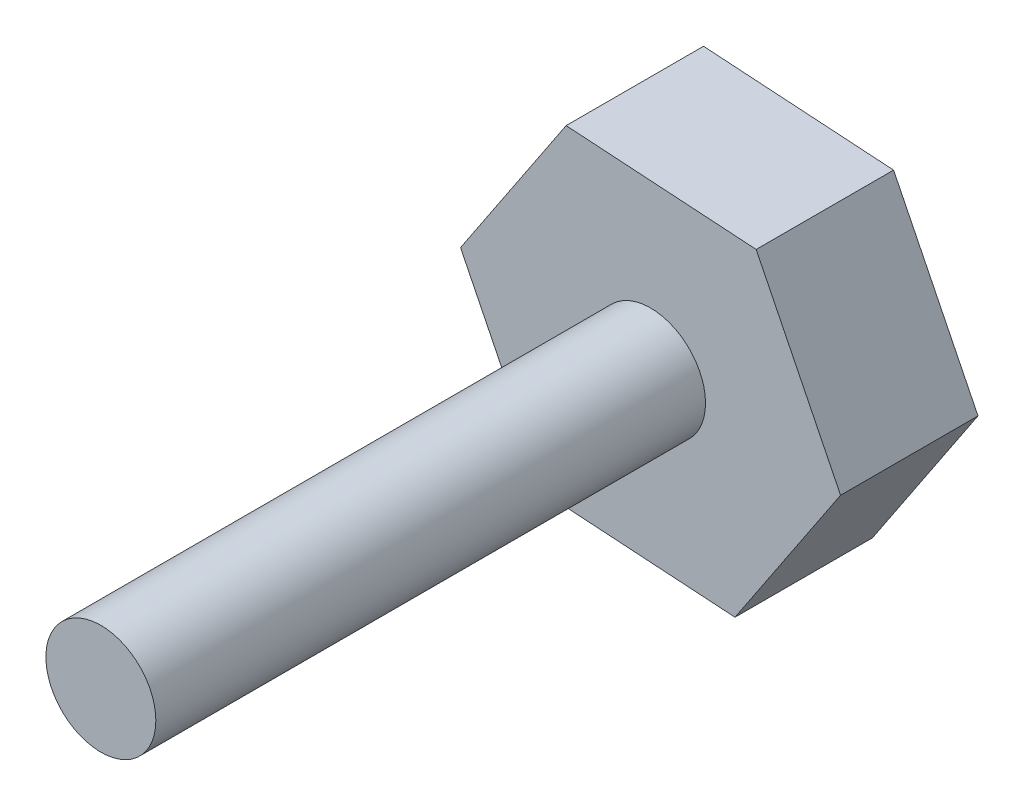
ISO-10303-21;
HEADER;
FILE_DESCRIPTION(('STEP AP214'),'2;1');
FILE_NAME('part.step','',(''),(''),'','','');
FILE_SCHEMA(('AUTOMOTIVE_DESIGN { 1 0 10303 214 1 1 1 1 }'));
ENDSEC;
DATA;
#1=APPLICATION_CONTEXT('core data for automotive mechanical design processes');
#2=APPLICATION_PROTOCOL_DEFINITION('international standard','automotive_design',2000,#1);
#3=PRODUCT_CONTEXT('',#1,'mechanical');
#4=PRODUCT('Part','Part','',(#3));
#5=PRODUCT_RELATED_PRODUCT_CATEGORY('part','',(#4));
#6=PRODUCT_DEFINITION_FORMATION('','',#4);
#7=PRODUCT_DEFINITION_CONTEXT('part definition',#1,'design');
#8=PRODUCT_DEFINITION('design','',#6,#7);
#9=PRODUCT_DEFINITION_SHAPE('','',#8);
#10=(LENGTH_UNIT() NAMED_UNIT(*) SI_UNIT(.MILLI.,.METRE.));
#11=(NAMED_UNIT(*) PLANE_ANGLE_UNIT() SI_UNIT($,.RADIAN.));
#12=(NAMED_UNIT(*) SI_UNIT($,.STERADIAN.) SOLID_ANGLE_UNIT());
#13=UNCERTAINTY_MEASURE_WITH_UNIT(LENGTH_MEASURE(1.E-05),#10,'distance_accuracy_value','');
#14=(GEOMETRIC_REPRESENTATION_CONTEXT(3) GLOBAL_UNCERTAINTY_ASSIGNED_CONTEXT((#13)) GLOBAL_UNIT_ASSIGNED_CONTEXT((#10,
#11,#12)) REPRESENTATION_CONTEXT('',''));
#15=CARTESIAN_POINT('',(0.,0.,0.));
#16=DIRECTION('',(0.,0.,1.));
#17=DIRECTION('',(1.,0.,0.));
#18=AXIS2_PLACEMENT_3D('',#15,#16,#17);
#19=CARTESIAN_POINT('',(0.,0.,6.35));
#20=DIRECTION('',(0.,0.,1.));
#21=DIRECTION('',(1.,0.,0.));
#22=AXIS2_PLACEMENT_3D('',#19,#20,#21);
#23=PLANE('',#22);
#24=DIRECTION('',(0.997935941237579,-0.0642172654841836,0.));
#25=VECTOR('',#24,1.);
#26=CARTESIAN_POINT('',(-4.87966397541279,-7.32175385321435,6.35));
#27=LINE('',#26,#25);
#28=CARTESIAN_POINT('',(-4.87966397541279,-7.32175385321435,6.35));
#29=VERTEX_POINT('',#28);
#30=CARTESIAN_POINT('',(3.90099284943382,-7.88678989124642,6.35));
#31=VERTEX_POINT('',#30);
#32=EDGE_CURVE('E129',#29,#31,#27,.T.);
#33=ORIENTED_EDGE('',*,*,#32,.T.);
#34=DIRECTION('',(0.554581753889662,0.832129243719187,0.));
#35=VECTOR('',#34,1.);
#36=CARTESIAN_POINT('',(3.90099284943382,-7.88678989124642,6.35));
#37=LINE('',#36,#35);
#38=CARTESIAN_POINT('',(8.78065682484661,-0.565036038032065,6.35));
#39=VERTEX_POINT('',#38);
#40=EDGE_CURVE('E87',#31,#39,#37,.T.);
#41=ORIENTED_EDGE('',*,*,#40,.T.);
#42=DIRECTION('',(-0.443354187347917,0.89634650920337,0.));
#43=VECTOR('',#42,1.);
#44=CARTESIAN_POINT('',(8.78065682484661,-0.565036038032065,6.35));
#45=LINE('',#44,#43);
#46=CARTESIAN_POINT('',(4.87966397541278,7.32175385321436,6.35));
#47=VERTEX_POINT('',#46);
#48=EDGE_CURVE('E100',#39,#47,#45,.T.);
#49=ORIENTED_EDGE('',*,*,#48,.T.);
#50=DIRECTION('',(-0.99793594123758,0.0642172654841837,0.));
#51=VECTOR('',#50,1.);
#52=CARTESIAN_POINT('',(4.87966397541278,7.32175385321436,6.35));
#53=LINE('',#52,#51);
#54=CARTESIAN_POINT('',(-3.90099284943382,7.88678989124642,6.35));
#55=VERTEX_POINT('',#54);
#56=EDGE_CURVE('E94',#47,#55,#53,.T.);
#57=ORIENTED_EDGE('',*,*,#56,.T.);
#58=DIRECTION('',(-0.554581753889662,-0.832129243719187,0.));
#59=VECTOR('',#58,1.);
#60=CARTESIAN_POINT('',(-3.90099284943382,7.88678989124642,6.35));
#61=LINE('',#60,#59);
#62=CARTESIAN_POINT('',(-8.78065682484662,0.565036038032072,6.35));
#63=VERTEX_POINT('',#62);
#64=EDGE_CURVE('E98',#55,#63,#61,.T.);
#65=ORIENTED_EDGE('',*,*,#64,.T.);
#66=DIRECTION('',(0.443354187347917,-0.896346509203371,0.));
#67=VECTOR('',#66,1.);
#68=CARTESIAN_POINT('',(-8.78065682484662,0.565036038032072,6.35));
#69=LINE('',#68,#67);
#70=EDGE_CURVE('E50',#63,#29,#69,.T.);
#71=ORIENTED_EDGE('',*,*,#70,.T.);
#72=EDGE_LOOP('',(#33,#41,#49,#57,#65,#71));
#73=FACE_BOUND('',#72,.T.);
#74=CARTESIAN_POINT('',(0.,0.,6.35));
#75=DIRECTION('',(0.,0.,1.));
#76=DIRECTION('',(1.,0.,0.));
#77=AXIS2_PLACEMENT_3D('',#74,#75,#76);
#78=CIRCLE('',#77,2.54);
#79=CARTESIAN_POINT('',(2.54,0.,6.35));
#80=VERTEX_POINT('',#79);
#81=EDGE_CURVE('E169',#80,#80,#78,.T.);
#82=ORIENTED_EDGE('',*,*,#81,.F.);
#83=EDGE_LOOP('',(#82));
#84=FACE_BOUND('',#83,.T.);
#85=ADVANCED_FACE('F33',(#73,#84),#23,.T.);
#86=CARTESIAN_POINT('',(-4.87966397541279,-7.32175385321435,6.35));
#87=DIRECTION('',(0.0642172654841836,0.997935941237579,0.));
#88=DIRECTION('',(-0.99793594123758,0.0642172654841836,0.));
#89=AXIS2_PLACEMENT_3D('',#86,#87,#88);
#90=PLANE('',#89);
#91=DIRECTION('',(0.997935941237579,-0.0642172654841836,0.));
#92=VECTOR('',#91,1.);
#93=CARTESIAN_POINT('',(-4.87966397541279,-7.32175385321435,0.));
#94=LINE('',#93,#92);
#95=CARTESIAN_POINT('',(-4.87966397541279,-7.32175385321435,0.));
#96=VERTEX_POINT('',#95);
#97=CARTESIAN_POINT('',(3.90099284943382,-7.88678989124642,0.));
#98=VERTEX_POINT('',#97);
#99=EDGE_CURVE('E118',#96,#98,#94,.T.);
#100=ORIENTED_EDGE('',*,*,#99,.T.);
#101=DIRECTION('',(0.,0.,-1.));
#102=VECTOR('',#101,1.);
#103=CARTESIAN_POINT('',(3.90099284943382,-7.88678989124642,6.35));
#104=LINE('',#103,#102);
#105=EDGE_CURVE('E11',#31,#98,#104,.T.);
#106=ORIENTED_EDGE('',*,*,#105,.F.);
#107=ORIENTED_EDGE('',*,*,#32,.F.);
#108=DIRECTION('',(0.,0.,-1.));
#109=VECTOR('',#108,1.);
#110=CARTESIAN_POINT('',(-4.87966397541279,-7.32175385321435,6.35));
#111=LINE('',#110,#109);
#112=EDGE_CURVE('E114',#29,#96,#111,.T.);
#113=ORIENTED_EDGE('',*,*,#112,.T.);
#114=EDGE_LOOP('',(#100,#106,#107,#113));
#115=FACE_BOUND('',#114,.T.);
#116=ADVANCED_FACE('F35',(#115),#90,.F.);
#117=CARTESIAN_POINT('',(3.90099284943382,-7.88678989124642,6.35));
#118=DIRECTION('',(-0.832129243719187,0.554581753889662,0.));
#119=DIRECTION('',(-0.554581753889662,-0.832129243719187,0.));
#120=AXIS2_PLACEMENT_3D('',#117,#118,#119);
#121=PLANE('',#120);
#122=DIRECTION('',(0.554581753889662,0.832129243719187,0.));
#123=VECTOR('',#122,1.);
#124=CARTESIAN_POINT('',(3.90099284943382,-7.88678989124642,0.));
#125=LINE('',#124,#123);
#126=CARTESIAN_POINT('',(8.78065682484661,-0.565036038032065,0.));
#127=VERTEX_POINT('',#126);
#128=EDGE_CURVE('E121',#98,#127,#125,.T.);
#129=ORIENTED_EDGE('',*,*,#128,.T.);
#130=DIRECTION('',(0.,0.,-1.));
#131=VECTOR('',#130,1.);
#132=CARTESIAN_POINT('',(8.78065682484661,-0.565036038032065,6.35));
#133=LINE('',#132,#131);
#134=EDGE_CURVE('E42',#39,#127,#133,.T.);
#135=ORIENTED_EDGE('',*,*,#134,.F.);
#136=ORIENTED_EDGE('',*,*,#40,.F.);
#137=ORIENTED_EDGE('',*,*,#105,.T.);
#138=EDGE_LOOP('',(#129,#135,#136,#137));
#139=FACE_BOUND('',#138,.T.);
#140=ADVANCED_FACE('F157',(#139),#121,.F.);
#141=CARTESIAN_POINT('',(8.78065682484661,-0.565036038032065,6.35));
#142=DIRECTION('',(-0.89634650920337,-0.443354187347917,0.));
#143=DIRECTION('',(0.443354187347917,-0.89634650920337,0.));
#144=AXIS2_PLACEMENT_3D('',#141,#142,#143);
#145=PLANE('',#144);
#146=DIRECTION('',(-0.443354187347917,0.89634650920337,0.));
#147=VECTOR('',#146,1.);
#148=CARTESIAN_POINT('',(8.78065682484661,-0.565036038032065,0.));
#149=LINE('',#148,#147);
#150=CARTESIAN_POINT('',(4.87966397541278,7.32175385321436,0.));
#151=VERTEX_POINT('',#150);
#152=EDGE_CURVE('E124',#127,#151,#149,.T.);
#153=ORIENTED_EDGE('',*,*,#152,.T.);
#154=DIRECTION('',(0.,0.,-1.));
#155=VECTOR('',#154,1.);
#156=CARTESIAN_POINT('',(4.87966397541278,7.32175385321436,6.35));
#157=LINE('',#156,#155);
#158=EDGE_CURVE('E109',#47,#151,#157,.T.);
#159=ORIENTED_EDGE('',*,*,#158,.F.);
#160=ORIENTED_EDGE('',*,*,#48,.F.);
#161=ORIENTED_EDGE('',*,*,#134,.T.);
#162=EDGE_LOOP('',(#153,#159,#160,#161));
#163=FACE_BOUND('',#162,.T.);
#164=ADVANCED_FACE('F135',(#163),#145,.F.);
#165=CARTESIAN_POINT('',(4.87966397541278,7.32175385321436,6.35));
#166=DIRECTION('',(-0.0642172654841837,-0.997935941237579,0.));
#167=DIRECTION('',(0.99793594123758,-0.0642172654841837,0.));
#168=AXIS2_PLACEMENT_3D('',#165,#166,#167);
#169=PLANE('',#168);
#170=DIRECTION('',(-0.99793594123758,0.0642172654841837,0.));
#171=VECTOR('',#170,1.);
#172=CARTESIAN_POINT('',(4.87966397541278,7.32175385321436,0.));
#173=LINE('',#172,#171);
#174=CARTESIAN_POINT('',(-3.90099284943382,7.88678989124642,0.));
#175=VERTEX_POINT('',#174);
#176=EDGE_CURVE('E108',#151,#175,#173,.T.);
#177=ORIENTED_EDGE('',*,*,#176,.T.);
#178=DIRECTION('',(0.,0.,-1.));
#179=VECTOR('',#178,1.);
#180=CARTESIAN_POINT('',(-3.90099284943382,7.88678989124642,6.35));
#181=LINE('',#180,#179);
#182=EDGE_CURVE('E105',#55,#175,#181,.T.);
#183=ORIENTED_EDGE('',*,*,#182,.F.);
#184=ORIENTED_EDGE('',*,*,#56,.F.);
#185=ORIENTED_EDGE('',*,*,#158,.T.);
#186=EDGE_LOOP('',(#177,#183,#184,#185));
#187=FACE_BOUND('',#186,.T.);
#188=ADVANCED_FACE('F106',(#187),#169,.F.);
#189=CARTESIAN_POINT('',(-3.90099284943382,7.88678989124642,6.35));
#190=DIRECTION('',(0.832129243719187,-0.554581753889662,0.));
#191=DIRECTION('',(0.554581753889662,0.832129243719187,0.));
#192=AXIS2_PLACEMENT_3D('',#189,#190,#191);
#193=PLANE('',#192);
#194=DIRECTION('',(-0.554581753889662,-0.832129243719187,0.));
#195=VECTOR('',#194,1.);
#196=CARTESIAN_POINT('',(-3.90099284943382,7.88678989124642,0.));
#197=LINE('',#196,#195);
#198=CARTESIAN_POINT('',(-8.78065682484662,0.565036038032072,0.));
#199=VERTEX_POINT('',#198);
#200=EDGE_CURVE('E73',#175,#199,#197,.T.);
#201=ORIENTED_EDGE('',*,*,#200,.T.);
#202=DIRECTION('',(0.,0.,-1.));
#203=VECTOR('',#202,1.);
#204=CARTESIAN_POINT('',(-8.78065682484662,0.565036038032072,6.35));
#205=LINE('',#204,#203);
#206=EDGE_CURVE('E110',#63,#199,#205,.T.);
#207=ORIENTED_EDGE('',*,*,#206,.F.);
#208=ORIENTED_EDGE('',*,*,#64,.F.);
#209=ORIENTED_EDGE('',*,*,#182,.T.);
#210=EDGE_LOOP('',(#201,#207,#208,#209));
#211=FACE_BOUND('',#210,.T.);
#212=ADVANCED_FACE('F112',(#211),#193,.F.);
#213=CARTESIAN_POINT('',(-8.78065682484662,0.565036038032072,6.35));
#214=DIRECTION('',(0.896346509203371,0.443354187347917,0.));
#215=DIRECTION('',(-0.443354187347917,0.896346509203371,0.));
#216=AXIS2_PLACEMENT_3D('',#213,#214,#215);
#217=PLANE('',#216);
#218=DIRECTION('',(0.443354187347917,-0.896346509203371,0.));
#219=VECTOR('',#218,1.);
#220=CARTESIAN_POINT('',(-8.78065682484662,0.565036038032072,0.));
#221=LINE('',#220,#219);
#222=EDGE_CURVE('E79',#199,#96,#221,.T.);
#223=ORIENTED_EDGE('',*,*,#222,.T.);
#224=ORIENTED_EDGE('',*,*,#112,.F.);
#225=ORIENTED_EDGE('',*,*,#70,.F.);
#226=ORIENTED_EDGE('',*,*,#206,.T.);
#227=EDGE_LOOP('',(#223,#224,#225,#226));
#228=FACE_BOUND('',#227,.T.);
#229=ADVANCED_FACE('F142',(#228),#217,.F.);
#230=CARTESIAN_POINT('',(0.,0.,0.));
#231=DIRECTION('',(0.,0.,1.));
#232=DIRECTION('',(1.,0.,0.));
#233=AXIS2_PLACEMENT_3D('',#230,#231,#232);
#234=PLANE('',#233);
#235=ORIENTED_EDGE('',*,*,#99,.F.);
#236=ORIENTED_EDGE('',*,*,#222,.F.);
#237=ORIENTED_EDGE('',*,*,#200,.F.);
#238=ORIENTED_EDGE('',*,*,#176,.F.);
#239=ORIENTED_EDGE('',*,*,#152,.F.);
#240=ORIENTED_EDGE('',*,*,#128,.F.);
#241=EDGE_LOOP('',(#235,#236,#237,#238,#239,#240));
#242=FACE_BOUND('',#241,.T.);
#243=ADVANCED_FACE('F138',(#242),#234,.F.);
#244=CARTESIAN_POINT('',(0.,0.,31.75));
#245=DIRECTION('',(0.,0.,-1.));
#246=DIRECTION('',(-1.,0.,0.));
#247=AXIS2_PLACEMENT_3D('',#244,#245,#246);
#248=CYLINDRICAL_SURFACE('',#247,2.54);
#249=CARTESIAN_POINT('',(0.,0.,31.75));
#250=DIRECTION('',(0.,0.,1.));
#251=DIRECTION('',(1.,0.,0.));
#252=AXIS2_PLACEMENT_3D('',#249,#250,#251);
#253=CIRCLE('',#252,2.54);
#254=CARTESIAN_POINT('',(2.54,0.,31.75));
#255=VERTEX_POINT('',#254);
#256=EDGE_CURVE('E122',#255,#255,#253,.T.);
#257=ORIENTED_EDGE('',*,*,#256,.F.);
#258=EDGE_LOOP('',(#257));
#259=FACE_BOUND('',#258,.T.);
#260=ORIENTED_EDGE('',*,*,#81,.T.);
#261=EDGE_LOOP('',(#260));
#262=FACE_BOUND('',#261,.T.);
#263=ADVANCED_FACE('F149',(#259,#262),#248,.T.);
#264=CARTESIAN_POINT('',(0.,0.,31.75));
#265=DIRECTION('',(0.,0.,1.));
#266=DIRECTION('',(1.,0.,0.));
#267=AXIS2_PLACEMENT_3D('',#264,#265,#266);
#268=PLANE('',#267);
#269=ORIENTED_EDGE('',*,*,#256,.T.);
#270=EDGE_LOOP('',(#269));
#271=FACE_BOUND('',#270,.T.);
#272=ADVANCED_FACE('F161',(#271),#268,.T.);
#273=CLOSED_SHELL('',(#85,#116,#140,#164,#188,#212,#229,#243,#263,#272));
#274=MANIFOLD_SOLID_BREP('B2',#273);
#275=ADVANCED_BREP_SHAPE_REPRESENTATION('',(#18,#274),#14);
#276=SHAPE_DEFINITION_REPRESENTATION(#9,#275);
ENDSEC;
END-ISO-10303-21;
